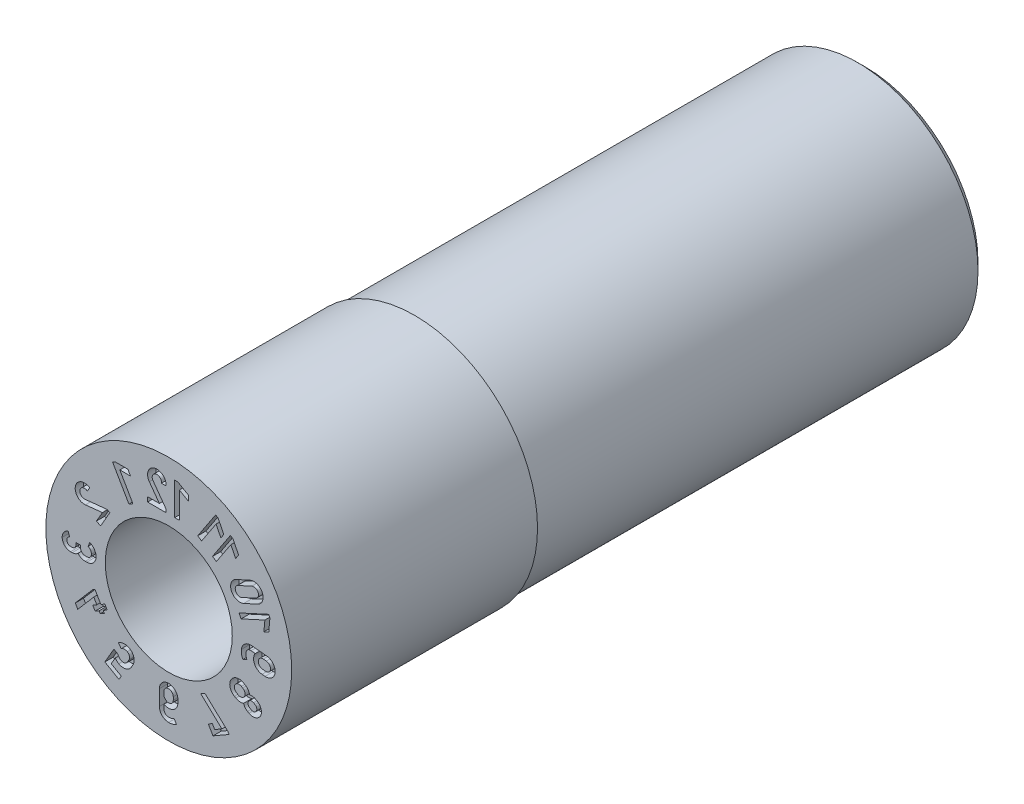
from build123d import *

# Parameters (mm, degrees)
SKETCH4_W          = 11
SKETCH4_H          = 1
CUT_EXTRUDE1_DEPTH = 0.2
CUT_EXTRUDE2_DEPTH = 1.4


with BuildPart() as part:
    # Sketch1 → Revolve1 (revolve)
    with BuildSketch(Plane(origin=(0, 0, 0), x_dir=(0, 0, -1), z_dir=(1, 0, 0)), mode=Mode.PRIVATE) as revolve1_sk:
        Polygon((0, 3), (0, 1.55), (2.8, 1.55), (2.8, 0.8), (14, 0.8), (14, 1.5), (17, 1.5), (17, 2.75), (16.75, 3), align=None)
    revolve(revolve1_sk.sketch.rotate(Axis((0, 0, 3.797909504), (0, 0, -1)), 90), axis=Axis((0, 0, 3.797909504), (0, 0, -1)))

    # Sketch4 → Cut-Revolve1 (revolve, cut)
    with BuildSketch(Plane(origin=(0, 0, 0), x_dir=(0, 0, -1), z_dir=(1, 0, 0)), mode=Mode.PRIVATE) as cut_revolve1_sk:
        with Locations((11.5, 3.435)):
            Rectangle(SKETCH4_W, SKETCH4_H)
    revolve(cut_revolve1_sk.sketch.rotate(Axis((0, 0, 0), (0, 0, -1)), 90), axis=Axis((0, 0, 0), (0, 0, -1)), mode=Mode.SUBTRACT)

    # Sketch2 → Cut-Extrude1 (cut)
    # profile 1 of 15: a face of its own
    with BuildSketch(Plane.XY):
        Polygon((1.504540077, 2.099663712), (1.56676782, 2.05853547), (1.703996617, 1.784946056), (1.631939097, 1.675921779), (1.514703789, 1.909561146), (1.161711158, 1.375477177), (1.067191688, 1.437948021), align=None)
    # profile 2 of 15: a face of its own
    with BuildSketch(Plane.XY):
        Polygon((1.143710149, 2.354168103), (1.205937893, 2.31303986), (1.34316669, 2.039450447), (1.27110917, 1.93042617), (1.153873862, 2.164065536), (0.80088123, 1.629981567), (0.706361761, 1.692452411), align=None)
    # profile 3 of 15: a face of its own
    with BuildSketch(Plane.XY):
        with BuildLine():
            Line((2.391484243, -0.005118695), (2.019163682, 0.029559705))
            ThreePointArc((2.019163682, 0.029559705), (1.853456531, -0.021646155), (1.772455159, -0.175007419))
            ThreePointArc((1.772455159, -0.175007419), (1.776698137, -0.275805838), (1.807754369, -0.371794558))
            Line((1.807754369, -0.371794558), (1.910064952, -0.322612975))
            ThreePointArc((1.910064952, -0.322612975), (1.886093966, -0.251740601), (1.886419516, -0.176924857))
            ThreePointArc((1.886419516, -0.176924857), (1.929158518, -0.106137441), (2.008617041, -0.083250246))
            Line((2.008617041, -0.083250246), (2.112173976, -0.092922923))
            ThreePointArc((2.112173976, -0.092922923), (2.090630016, -0.318872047), (2.276014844, -0.449828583))
            Line((2.276014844, -0.449828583), (2.349218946, -0.456404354))
            ThreePointArc((2.349218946, -0.456404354), (2.595994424, -0.251894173), (2.391484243, -0.005118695))
        make_face()
        with BuildLine():
            Line((2.380951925, -0.117990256), (2.307631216, -0.111148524))
            ThreePointArc((2.307631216, -0.111148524), (2.184278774, -0.213448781), (2.286583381, -0.336797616))
            Line((2.286583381, -0.336797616), (2.359888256, -0.343637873))
            ThreePointArc((2.359888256, -0.343637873), (2.483243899, -0.241345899), (2.380951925, -0.117990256))
        make_face(mode=Mode.SUBTRACT)
    # profile 4 of 15: a face of its own
    with BuildSketch(Plane.XY):
        Polygon((0.780813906, -1.606569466), (0.883247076, -1.547429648), (1.444601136, -2.076428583), (1.471791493, -2.123523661), (1.079259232, -2.350152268), (0.965944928, -2.153886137), (1.064091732, -2.097221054), (1.120740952, -2.195340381), (1.297361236, -2.093368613), align=None)
    # profile 5 of 15: a face of its own
    with BuildSketch(Plane.XY):
        with BuildLine():
            Line((1.862289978, -0.878798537), (1.827973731, -0.858949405))
            ThreePointArc((1.827973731, -0.858949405), (1.518236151, -0.941810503), (1.601345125, -1.251481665))
            Line((1.601345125, -1.251481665), (1.635665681, -1.271296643))
            ThreePointArc((1.635665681, -1.271296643), (1.729541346, -1.300831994), (1.827084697, -1.287783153))
            ThreePointArc((1.827084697, -1.287783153), (1.862355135, -1.358397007), (1.921768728, -1.410361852))
            Line((1.921768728, -1.410361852), (1.956123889, -1.430163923))
            ThreePointArc((1.956123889, -1.430163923), (2.234666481, -1.355512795), (2.160015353, -1.076970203))
            Line((2.160015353, -1.076970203), (2.125744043, -1.057037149))
            ThreePointArc((2.125744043, -1.057037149), (2.05107211, -1.031419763), (1.972280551, -1.03632264))
            ThreePointArc((1.972280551, -1.03632264), (1.934803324, -0.945328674), (1.862289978, -0.878798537))
        make_face()
        with BuildLine():
            Line((1.978413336, -1.312240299), (2.01276804, -1.332038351))
            ThreePointArc((2.01276804, -1.332038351), (2.136591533, -1.298859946), (2.103413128, -1.175036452))
            Line((2.103413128, -1.175036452), (2.06909016, -1.155183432))
            ThreePointArc((2.06909016, -1.155183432), (1.945097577, -1.188300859), (1.978413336, -1.312240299))
        make_face(mode=Mode.SUBTRACT)
        with BuildLine():
            Line((1.657975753, -1.153356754), (1.692347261, -1.173201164))
            ThreePointArc((1.692347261, -1.173201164), (1.847111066, -1.131713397), (1.8056233, -0.976949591))
            Line((1.8056233, -0.976949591), (1.77130591, -0.957063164))
            ThreePointArc((1.77130591, -0.957063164), (1.616535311, -0.99856871), (1.657975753, -1.153356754))
        make_face(mode=Mode.SUBTRACT)
    # profile 6 of 15: a face of its own
    with BuildSketch(Plane.XY):
        Polygon((2.437380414, 0.898792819), (2.468512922, 0.831009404), (2.440605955, 0.526207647), (2.321848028, 0.471662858), (2.345641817, 0.731980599), (1.763875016, 0.464778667), (1.716586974, 0.567736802), align=None)
    # profile 7 of 15: a face of its own
    with BuildSketch(Plane.XY):
        with BuildLine():
            Line((1.980886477, 1.392370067), (1.641083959, 1.236300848))
            ThreePointArc((1.641083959, 1.236300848), (1.52969504, 0.935721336), (1.830280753, 0.824349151))
            Line((1.830280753, 0.824349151), (2.170091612, 0.9804222))
            ThreePointArc((2.170091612, 0.9804222), (2.281462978, 1.280998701), (1.980886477, 1.392370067))
        make_face()
        with BuildLine():
            Line((1.782979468, 0.927336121), (2.122790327, 1.08340917))
            ThreePointArc((2.122790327, 1.08340917), (2.178476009, 1.233697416), (2.028187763, 1.289383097))
            Line((2.028187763, 1.289383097), (1.688369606, 1.133306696))
            ThreePointArc((1.688369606, 1.133306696), (1.632685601, 0.983014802), (1.782979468, 0.927336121))
        make_face(mode=Mode.SUBTRACT)
    # profile 8 of 15: a face of its own
    with BuildSketch(Plane.XY):
        Polygon((0.145054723, 2.589659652), (0.219645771, 2.589659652), (0.484981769, 2.437082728), (0.484981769, 2.306397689), (0.258353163, 2.436670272), (0.258353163, 1.796475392), (0.145054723, 1.796475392), align=None)
    # profile 9 of 15: a face of its own
    with BuildSketch(Plane.XY):
        with BuildLine():
            Line((-0.517439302, 1.794737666), (-0.064182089, 1.794737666))
            Line((-0.064182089, 1.794737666), (-0.064182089, 1.869677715))
            Line((-0.064182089, 1.869677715), (-0.38282007, 2.31205244))
            ThreePointArc((-0.38282007, 2.31205244), (-0.317437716, 2.488485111), (-0.178781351, 2.361293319))
            Line((-0.178781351, 2.361293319), (-0.064811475, 2.36129041))
            ThreePointArc((-0.064811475, 2.36129041), (-0.352403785, 2.59639621), (-0.474915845, 2.245718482))
            Line((-0.474915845, 2.245718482), (-0.228466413, 1.908067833))
            Line((-0.228466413, 1.908067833), (-0.517439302, 1.908067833))
            Line((-0.517439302, 1.908067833), (-0.517439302, 1.794737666))
        make_face()
    # profile 10 of 15: a face of its own
    with BuildSketch(Plane.XY):
        Polygon((-1.369741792, 2.210563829), (-1.30514405, 2.247859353), (-0.999067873, 2.24839186), (-0.933725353, 2.135215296), (-1.195127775, 2.134720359), (-0.875030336, 1.58029533), (-0.973149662, 1.52364611), align=None)
    # profile 11 of 15: a face of its own
    with BuildSketch(Plane.XY):
        with BuildLine():
            Line((0.223004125, -2.006818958), (0.223258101, -2.080317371))
            ThreePointArc((0.223258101, -2.080317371), (0.110091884, -2.277067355), (-0.116881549, -2.276609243))
            Line((-0.116881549, -2.276609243), (-0.116891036, -2.380616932))
            ThreePointArc((-0.116891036, -2.380616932), (-0.086720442, -2.457605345), (-0.012268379, -2.493582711))
            ThreePointArc((-0.012268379, -2.493582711), (0.062248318, -2.486956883), (0.130582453, -2.456508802))
            Line((0.130582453, -2.456508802), (0.189070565, -2.553815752))
            ThreePointArc((0.189070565, -2.553815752), (0.096382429, -2.593655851), (-0.003585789, -2.607245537))
            ThreePointArc((-0.003585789, -2.607245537), (-0.163809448, -2.540843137), (-0.230189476, -2.380610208))
            Line((-0.230189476, -2.380610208), (-0.230252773, -2.006664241))
            ThreePointArc((-0.230252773, -2.006664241), (-0.003546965, -1.780113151), (0.223004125, -2.006818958))
        make_face()
        with BuildLine():
            Line((-0.116891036, -2.006678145), (-0.116891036, -2.080317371))
            ThreePointArc((-0.116891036, -2.080317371), (-0.003572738, -2.193631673), (0.109737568, -2.08030938))
            Line((0.109737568, -2.08030938), (0.109737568, -2.006686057))
            ThreePointArc((0.109737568, -2.006686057), (-0.003572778, -1.893367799), (-0.116891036, -2.006678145))
        make_face(mode=Mode.SUBTRACT)
    # profile 12 of 15: a face of its own
    with BuildSketch(Plane.XY):
        with BuildLine():
            Line((-1.307500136, -1.897256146), (-1.404300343, -2.064919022))
            Line((-1.404300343, -2.064919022), (-1.158961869, -2.206565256))
            Line((-1.158961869, -2.206565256), (-1.215629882, -2.304717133))
            Line((-1.215629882, -2.304717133), (-1.559088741, -2.106421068))
            Line((-1.559088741, -2.106421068), (-1.339154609, -1.725483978))
            Line((-1.339154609, -1.725483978), (-1.241035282, -1.782133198))
            ThreePointArc((-1.241035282, -1.782133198), (-1.211462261, -1.836248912), (-1.164540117, -1.87626624))
            ThreePointArc((-1.164540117, -1.87626624), (-1.078560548, -1.887592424), (-1.009777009, -1.83477582))
            Line((-1.009777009, -1.83477582), (-0.972924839, -1.771009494))
            ThreePointArc((-0.972924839, -1.771009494), (-0.961588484, -1.685019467), (-1.014411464, -1.616226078))
            ThreePointArc((-1.014411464, -1.616226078), (-1.089186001, -1.5991495), (-1.160626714, -1.627061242))
            Line((-1.160626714, -1.627061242), (-1.231173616, -1.538265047))
            ThreePointArc((-1.231173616, -1.538265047), (-1.097577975, -1.48602976), (-0.957758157, -1.518072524))
            ThreePointArc((-0.957758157, -1.518072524), (-0.852225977, -1.655703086), (-0.87480656, -1.827660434))
            Line((-0.87480656, -1.827660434), (-0.911697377, -1.89136685))
            ThreePointArc((-0.911697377, -1.89136685), (-1.049302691, -1.996836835), (-1.221216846, -1.974372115))
            ThreePointArc((-1.221216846, -1.974372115), (-1.26837267, -1.940305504), (-1.307500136, -1.897256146))
        make_face()
    # profile 13 of 15: a face of its own
    with BuildSketch(Plane.XY):
        with BuildLine():
            Line((-2.00050738, -0.105027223), (-2.040167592, -0.105027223))
            ThreePointArc((-2.040167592, -0.105027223), (-2.120272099, -0.071846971), (-2.15345249, 0.008257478))
            Line((-2.15345249, 0.008257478), (-2.15345249, 0.064904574))
            Line((-2.15345249, 0.064904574), (-2.266782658, 0.064904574))
            Line((-2.266782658, 0.064904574), (-2.266782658, 0.008271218))
            ThreePointArc((-2.266782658, 0.008271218), (-2.293331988, -0.05582455), (-2.357427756, -0.082373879))
            Line((-2.357427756, -0.082373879), (-2.39708248, -0.082373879))
            ThreePointArc((-2.39708248, -0.082373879), (-2.461155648, -0.055802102), (-2.487732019, 0.008269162))
            ThreePointArc((-2.487732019, 0.008269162), (-2.468633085, 0.067742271), (-2.418407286, 0.104879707))
            Line((-2.418407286, 0.104879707), (-2.454672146, 0.212246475))
            ThreePointArc((-2.454672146, 0.212246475), (-2.560655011, 0.133802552), (-2.601048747, 0.008286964))
            ThreePointArc((-2.601048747, 0.008286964), (-2.541319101, -0.135964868), (-2.397071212, -0.195704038))
            Line((-2.397071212, -0.195704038), (-2.357427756, -0.195704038))
            ThreePointArc((-2.357427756, -0.195704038), (-2.280011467, -0.180434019), (-2.214191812, -0.136911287))
            ThreePointArc((-2.214191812, -0.136911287), (-2.136240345, -0.196999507), (-2.040162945, -0.218357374))
            Line((-2.040162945, -0.218357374), (-2.000488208, -0.218357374))
            ThreePointArc((-2.000488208, -0.218357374), (-1.84025356, -0.151979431), (-1.773897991, 0.008264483))
            ThreePointArc((-1.773897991, 0.008264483), (-1.816118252, 0.145324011), (-1.928117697, 0.23490073))
            Line((-1.928117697, 0.23490073), (-1.969693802, 0.129521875))
            ThreePointArc((-1.969693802, 0.129521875), (-1.909776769, 0.081605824), (-1.887196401, 0.008283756))
            ThreePointArc((-1.887196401, 0.008283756), (-1.920384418, -0.071839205), (-2.00050738, -0.105027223))
        make_face()
    # profile 14 of 15: a face of its own
    with BuildSketch(Plane.XY):
        Polygon((-2.280994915, -1.220594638), (-2.220982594, -1.324539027), (-1.829479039, -0.869531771), (-1.756077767, -0.996666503), (-1.854197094, -1.053315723), (-1.797547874, -1.151435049), (-1.699428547, -1.09478583), (-1.671096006, -1.143859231), (-1.572976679, -1.087210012), (-1.60130922, -1.03813661), (-1.503162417, -0.981471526), (-1.559811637, -0.883352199), (-1.65795844, -0.940017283), (-1.799605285, -0.694677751), (-1.856976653, -0.727801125), align=None)
    # profile 15 of 15: a face of its own
    with BuildSketch(Plane.XY):
        with BuildLine():
            Line((-1.763263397, 0.7709188), (-1.665116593, 0.714253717))
            Line((-1.665116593, 0.714253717), (-1.438487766, 1.10678636))
            Line((-1.438487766, 1.10678636), (-1.503386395, 1.144255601))
            Line((-1.503386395, 1.144255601), (-2.045813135, 1.089494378))
            ThreePointArc((-2.045813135, 1.089494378), (-2.16591142, 1.234326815), (-1.986440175, 1.290807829))
            Line((-1.986440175, 1.290807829), (-1.92945527, 1.389513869))
            ThreePointArc((-1.92945527, 1.389513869), (-2.276852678, 1.258003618), (-2.034415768, 0.976571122))
            Line((-2.034415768, 0.976571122), (-1.618776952, 1.021176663))
            Line((-1.618776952, 1.021176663), (-1.763263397, 0.7709188))
        make_face()
    extrude(amount=-CUT_EXTRUDE1_DEPTH, mode=Mode.SUBTRACT)

    # Sketch3 → Cut-Extrude2 (cut)
    with BuildSketch(Plane.XY.offset(-2.8)):
        Polygon((0.461880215, 0.8), (-0.461880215, 0.8), (-0.923760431, 0), (-0.461880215, -0.8), (0.461880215, -0.8), (0.923760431, 0), align=None)
    extrude(amount=-CUT_EXTRUDE2_DEPTH, mode=Mode.SUBTRACT)


solid = part.part
